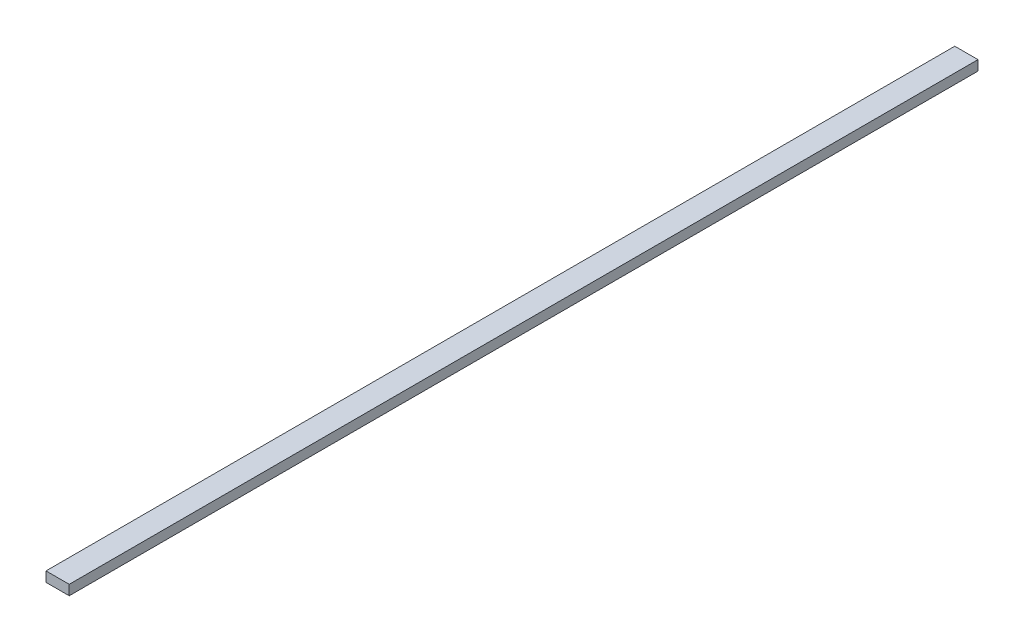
from build123d import *

# Parameters (mm, degrees)
SKETCH1_W           = 88.9
SKETCH1_H           = 3479.8
BOSS_EXTRUDE1_DEPTH = 38.1


with BuildPart() as part:
    # Sketch1 → Boss-Extrude1 (new body)
    with BuildSketch(Plane(origin=(0, 0, 0), x_dir=(1, 0, 0), z_dir=(0, 1, 0))):
        with Locations((-44.45, -1739.9)):
            Rectangle(SKETCH1_W, SKETCH1_H)
    extrude(amount=BOSS_EXTRUDE1_DEPTH)


solid = part.part
